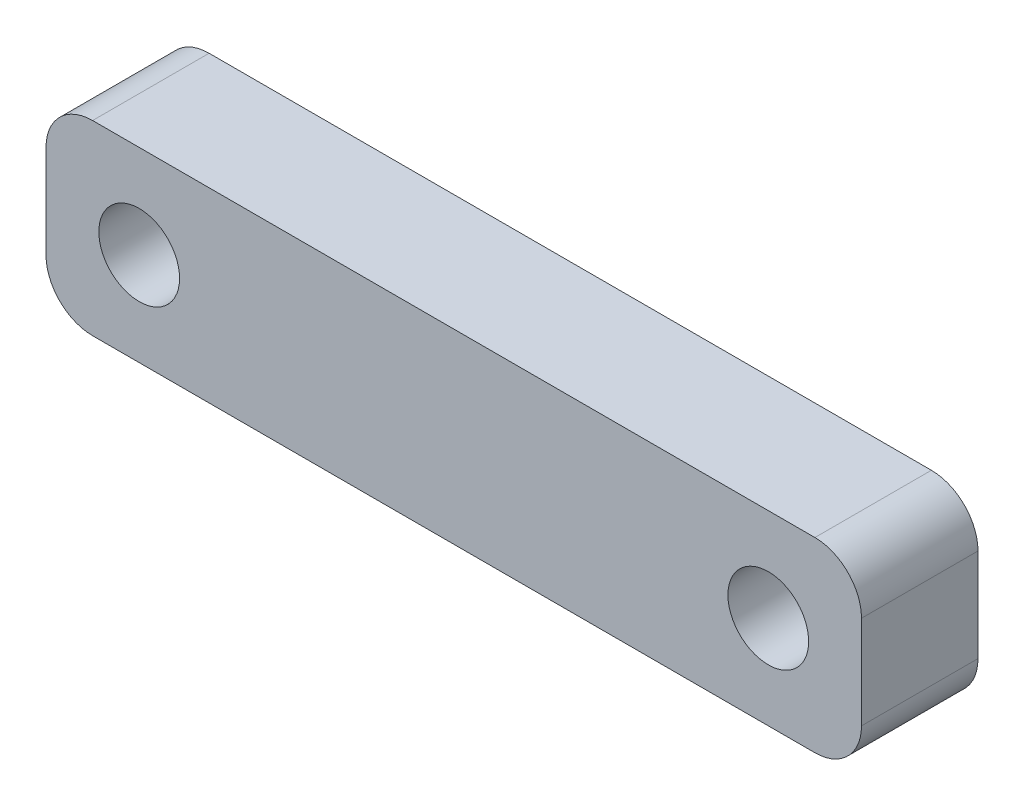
ISO-10303-21;
HEADER;
FILE_DESCRIPTION(('STEP AP214'),'2;1');
FILE_NAME('part.step','',(''),(''),'','','');
FILE_SCHEMA(('AUTOMOTIVE_DESIGN { 1 0 10303 214 1 1 1 1 }'));
ENDSEC;
DATA;
#1=APPLICATION_CONTEXT('core data for automotive mechanical design processes');
#2=APPLICATION_PROTOCOL_DEFINITION('international standard','automotive_design',2000,#1);
#3=PRODUCT_CONTEXT('',#1,'mechanical');
#4=PRODUCT('Part','Part','',(#3));
#5=PRODUCT_RELATED_PRODUCT_CATEGORY('part','',(#4));
#6=PRODUCT_DEFINITION_FORMATION('','',#4);
#7=PRODUCT_DEFINITION_CONTEXT('part definition',#1,'design');
#8=PRODUCT_DEFINITION('design','',#6,#7);
#9=PRODUCT_DEFINITION_SHAPE('','',#8);
#10=(LENGTH_UNIT() NAMED_UNIT(*) SI_UNIT(.MILLI.,.METRE.));
#11=(NAMED_UNIT(*) PLANE_ANGLE_UNIT() SI_UNIT($,.RADIAN.));
#12=(NAMED_UNIT(*) SI_UNIT($,.STERADIAN.) SOLID_ANGLE_UNIT());
#13=UNCERTAINTY_MEASURE_WITH_UNIT(LENGTH_MEASURE(1.E-05),#10,'distance_accuracy_value','');
#14=(GEOMETRIC_REPRESENTATION_CONTEXT(3) GLOBAL_UNCERTAINTY_ASSIGNED_CONTEXT((#13)) GLOBAL_UNIT_ASSIGNED_CONTEXT((#10,
#11,#12)) REPRESENTATION_CONTEXT('',''));
#15=CARTESIAN_POINT('',(0.,0.,0.));
#16=DIRECTION('',(0.,0.,1.));
#17=DIRECTION('',(1.,0.,0.));
#18=AXIS2_PLACEMENT_3D('',#15,#16,#17);
#19=CARTESIAN_POINT('',(0.,0.,6.35));
#20=DIRECTION('',(0.,0.,-1.));
#21=DIRECTION('',(-1.,0.,0.));
#22=AXIS2_PLACEMENT_3D('',#19,#20,#21);
#23=PLANE('',#22);
#24=CARTESIAN_POINT('',(-173.14751190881,-22.7362765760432,6.35));
#25=DIRECTION('',(0.,0.,1.));
#26=DIRECTION('',(1.,0.,0.));
#27=AXIS2_PLACEMENT_3D('',#24,#25,#26);
#28=CIRCLE('',#27,2.20000000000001);
#29=CARTESIAN_POINT('',(-170.94751190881,-22.7362765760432,6.35));
#30=VERTEX_POINT('',#29);
#31=EDGE_CURVE('E168',#30,#30,#28,.T.);
#32=ORIENTED_EDGE('',*,*,#31,.F.);
#33=EDGE_LOOP('',(#32));
#34=FACE_BOUND('',#33,.T.);
#35=DIRECTION('',(0.,1.,0.));
#36=VECTOR('',#35,1.);
#37=CARTESIAN_POINT('',(-133.77751190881,-27.8162765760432,6.35));
#38=LINE('',#37,#36);
#39=CARTESIAN_POINT('',(-133.77751190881,-25.2762765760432,6.35));
#40=VERTEX_POINT('',#39);
#41=CARTESIAN_POINT('',(-133.77751190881,-20.1962765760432,6.35));
#42=VERTEX_POINT('',#41);
#43=EDGE_CURVE('E172',#40,#42,#38,.T.);
#44=ORIENTED_EDGE('',*,*,#43,.T.);
#45=CARTESIAN_POINT('',(-136.31751190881,-20.1962765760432,6.35));
#46=DIRECTION('',(0.,0.,-1.));
#47=DIRECTION('',(-1.,0.,0.));
#48=AXIS2_PLACEMENT_3D('',#45,#46,#47);
#49=CIRCLE('',#48,2.54);
#50=CARTESIAN_POINT('',(-136.31751190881,-17.6562765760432,6.35));
#51=VERTEX_POINT('',#50);
#52=EDGE_CURVE('E149',#42,#51,#49,.F.);
#53=ORIENTED_EDGE('',*,*,#52,.T.);
#54=DIRECTION('',(-1.,0.,0.));
#55=VECTOR('',#54,1.);
#56=CARTESIAN_POINT('',(-178.22751190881,-17.6562765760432,6.35));
#57=LINE('',#56,#55);
#58=CARTESIAN_POINT('',(-175.68751190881,-17.6562765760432,6.35));
#59=VERTEX_POINT('',#58);
#60=EDGE_CURVE('E120',#51,#59,#57,.T.);
#61=ORIENTED_EDGE('',*,*,#60,.T.);
#62=CARTESIAN_POINT('',(-175.68751190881,-20.1962765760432,6.35));
#63=DIRECTION('',(0.,0.,-1.));
#64=DIRECTION('',(-1.,0.,0.));
#65=AXIS2_PLACEMENT_3D('',#62,#63,#64);
#66=CIRCLE('',#65,2.54);
#67=CARTESIAN_POINT('',(-178.22751190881,-20.1962765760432,6.35));
#68=VERTEX_POINT('',#67);
#69=EDGE_CURVE('E145',#59,#68,#66,.F.);
#70=ORIENTED_EDGE('',*,*,#69,.T.);
#71=DIRECTION('',(0.,-1.,0.));
#72=VECTOR('',#71,1.);
#73=CARTESIAN_POINT('',(-178.22751190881,-27.8162765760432,6.35));
#74=LINE('',#73,#72);
#75=CARTESIAN_POINT('',(-178.22751190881,-25.2762765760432,6.35));
#76=VERTEX_POINT('',#75);
#77=EDGE_CURVE('E128',#68,#76,#74,.T.);
#78=ORIENTED_EDGE('',*,*,#77,.T.);
#79=CARTESIAN_POINT('',(-175.68751190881,-25.2762765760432,6.35));
#80=DIRECTION('',(0.,0.,-1.));
#81=DIRECTION('',(-1.,0.,0.));
#82=AXIS2_PLACEMENT_3D('',#79,#80,#81);
#83=CIRCLE('',#82,2.54);
#84=CARTESIAN_POINT('',(-175.68751190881,-27.8162765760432,6.35));
#85=VERTEX_POINT('',#84);
#86=EDGE_CURVE('E55',#76,#85,#83,.F.);
#87=ORIENTED_EDGE('',*,*,#86,.T.);
#88=DIRECTION('',(1.,0.,0.));
#89=VECTOR('',#88,1.);
#90=CARTESIAN_POINT('',(-178.22751190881,-27.8162765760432,6.35));
#91=LINE('',#90,#89);
#92=CARTESIAN_POINT('',(-136.31751190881,-27.8162765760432,6.35));
#93=VERTEX_POINT('',#92);
#94=EDGE_CURVE('E131',#85,#93,#91,.T.);
#95=ORIENTED_EDGE('',*,*,#94,.T.);
#96=CARTESIAN_POINT('',(-136.31751190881,-25.2762765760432,6.35));
#97=DIRECTION('',(0.,0.,-1.));
#98=DIRECTION('',(-1.,0.,0.));
#99=AXIS2_PLACEMENT_3D('',#96,#97,#98);
#100=CIRCLE('',#99,2.54);
#101=EDGE_CURVE('E147',#93,#40,#100,.F.);
#102=ORIENTED_EDGE('',*,*,#101,.T.);
#103=EDGE_LOOP('',(#44,#53,#61,#70,#78,#87,#95,#102));
#104=FACE_BOUND('',#103,.T.);
#105=CARTESIAN_POINT('',(-138.85751190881,-22.7362765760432,6.35));
#106=DIRECTION('',(0.,0.,1.));
#107=DIRECTION('',(-1.,0.,0.));
#108=AXIS2_PLACEMENT_3D('',#105,#106,#107);
#109=CIRCLE('',#108,2.20000000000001);
#110=CARTESIAN_POINT('',(-141.05751190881,-22.7362765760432,6.35));
#111=VERTEX_POINT('',#110);
#112=EDGE_CURVE('E178',#111,#111,#109,.T.);
#113=ORIENTED_EDGE('',*,*,#112,.F.);
#114=EDGE_LOOP('',(#113));
#115=FACE_BOUND('',#114,.T.);
#116=ADVANCED_FACE('F33',(#34,#104,#115),#23,.F.);
#117=CARTESIAN_POINT('',(0.,0.,0.));
#118=DIRECTION('',(0.,0.,-1.));
#119=DIRECTION('',(-1.,0.,0.));
#120=AXIS2_PLACEMENT_3D('',#117,#118,#119);
#121=PLANE('',#120);
#122=CARTESIAN_POINT('',(-173.14751190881,-22.7362765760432,0.));
#123=DIRECTION('',(0.,0.,1.));
#124=DIRECTION('',(1.,0.,0.));
#125=AXIS2_PLACEMENT_3D('',#122,#123,#124);
#126=CIRCLE('',#125,2.20000000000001);
#127=CARTESIAN_POINT('',(-170.94751190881,-22.7362765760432,0.));
#128=VERTEX_POINT('',#127);
#129=EDGE_CURVE('E175',#128,#128,#126,.T.);
#130=ORIENTED_EDGE('',*,*,#129,.T.);
#131=EDGE_LOOP('',(#130));
#132=FACE_BOUND('',#131,.T.);
#133=DIRECTION('',(-1.,0.,0.));
#134=VECTOR('',#133,1.);
#135=CARTESIAN_POINT('',(-178.22751190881,-17.6562765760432,0.));
#136=LINE('',#135,#134);
#137=CARTESIAN_POINT('',(-136.31751190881,-17.6562765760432,0.));
#138=VERTEX_POINT('',#137);
#139=CARTESIAN_POINT('',(-175.68751190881,-17.6562765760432,0.));
#140=VERTEX_POINT('',#139);
#141=EDGE_CURVE('E117',#138,#140,#136,.T.);
#142=ORIENTED_EDGE('',*,*,#141,.F.);
#143=CARTESIAN_POINT('',(-136.31751190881,-20.1962765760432,0.));
#144=DIRECTION('',(0.,0.,-1.));
#145=DIRECTION('',(-1.,0.,0.));
#146=AXIS2_PLACEMENT_3D('',#143,#144,#145);
#147=CIRCLE('',#146,2.54);
#148=CARTESIAN_POINT('',(-133.77751190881,-20.1962765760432,0.));
#149=VERTEX_POINT('',#148);
#150=EDGE_CURVE('E100',#138,#149,#147,.T.);
#151=ORIENTED_EDGE('',*,*,#150,.T.);
#152=DIRECTION('',(0.,1.,0.));
#153=VECTOR('',#152,1.);
#154=CARTESIAN_POINT('',(-133.77751190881,-27.8162765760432,0.));
#155=LINE('',#154,#153);
#156=CARTESIAN_POINT('',(-133.77751190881,-25.2762765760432,0.));
#157=VERTEX_POINT('',#156);
#158=EDGE_CURVE('E129',#157,#149,#155,.T.);
#159=ORIENTED_EDGE('',*,*,#158,.F.);
#160=CARTESIAN_POINT('',(-136.31751190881,-25.2762765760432,0.));
#161=DIRECTION('',(0.,0.,-1.));
#162=DIRECTION('',(-1.,0.,0.));
#163=AXIS2_PLACEMENT_3D('',#160,#161,#162);
#164=CIRCLE('',#163,2.54);
#165=CARTESIAN_POINT('',(-136.31751190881,-27.8162765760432,0.));
#166=VERTEX_POINT('',#165);
#167=EDGE_CURVE('E111',#157,#166,#164,.T.);
#168=ORIENTED_EDGE('',*,*,#167,.T.);
#169=DIRECTION('',(1.,0.,0.));
#170=VECTOR('',#169,1.);
#171=CARTESIAN_POINT('',(-178.22751190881,-27.8162765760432,0.));
#172=LINE('',#171,#170);
#173=CARTESIAN_POINT('',(-175.68751190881,-27.8162765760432,0.));
#174=VERTEX_POINT('',#173);
#175=EDGE_CURVE('E133',#174,#166,#172,.T.);
#176=ORIENTED_EDGE('',*,*,#175,.F.);
#177=CARTESIAN_POINT('',(-175.68751190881,-25.2762765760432,0.));
#178=DIRECTION('',(0.,0.,-1.));
#179=DIRECTION('',(-1.,0.,0.));
#180=AXIS2_PLACEMENT_3D('',#177,#178,#179);
#181=CIRCLE('',#180,2.54);
#182=CARTESIAN_POINT('',(-178.22751190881,-25.2762765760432,0.));
#183=VERTEX_POINT('',#182);
#184=EDGE_CURVE('E121',#174,#183,#181,.T.);
#185=ORIENTED_EDGE('',*,*,#184,.T.);
#186=DIRECTION('',(0.,-1.,0.));
#187=VECTOR('',#186,1.);
#188=CARTESIAN_POINT('',(-178.22751190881,-27.8162765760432,0.));
#189=LINE('',#188,#187);
#190=CARTESIAN_POINT('',(-178.22751190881,-20.1962765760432,0.));
#191=VERTEX_POINT('',#190);
#192=EDGE_CURVE('E160',#191,#183,#189,.T.);
#193=ORIENTED_EDGE('',*,*,#192,.F.);
#194=CARTESIAN_POINT('',(-175.68751190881,-20.1962765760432,0.));
#195=DIRECTION('',(0.,0.,-1.));
#196=DIRECTION('',(-1.,0.,0.));
#197=AXIS2_PLACEMENT_3D('',#194,#195,#196);
#198=CIRCLE('',#197,2.54);
#199=EDGE_CURVE('E127',#191,#140,#198,.T.);
#200=ORIENTED_EDGE('',*,*,#199,.T.);
#201=EDGE_LOOP('',(#142,#151,#159,#168,#176,#185,#193,#200));
#202=FACE_BOUND('',#201,.T.);
#203=CARTESIAN_POINT('',(-138.85751190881,-22.7362765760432,0.));
#204=DIRECTION('',(0.,0.,1.));
#205=DIRECTION('',(-1.,0.,0.));
#206=AXIS2_PLACEMENT_3D('',#203,#204,#205);
#207=CIRCLE('',#206,2.20000000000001);
#208=CARTESIAN_POINT('',(-141.05751190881,-22.7362765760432,0.));
#209=VERTEX_POINT('',#208);
#210=EDGE_CURVE('E181',#209,#209,#207,.T.);
#211=ORIENTED_EDGE('',*,*,#210,.T.);
#212=EDGE_LOOP('',(#211));
#213=FACE_BOUND('',#212,.T.);
#214=ADVANCED_FACE('F124',(#132,#202,#213),#121,.T.);
#215=CARTESIAN_POINT('',(-178.22751190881,-27.8162765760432,6.35));
#216=DIRECTION('',(1.,0.,0.));
#217=DIRECTION('',(0.,0.,-1.));
#218=AXIS2_PLACEMENT_3D('',#215,#216,#217);
#219=PLANE('',#218);
#220=ORIENTED_EDGE('',*,*,#77,.F.);
#221=DIRECTION('',(0.,0.,-1.));
#222=VECTOR('',#221,1.);
#223=CARTESIAN_POINT('',(-178.22751190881,-20.1962765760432,6.35));
#224=LINE('',#223,#222);
#225=EDGE_CURVE('E11',#68,#191,#224,.T.);
#226=ORIENTED_EDGE('',*,*,#225,.T.);
#227=ORIENTED_EDGE('',*,*,#192,.T.);
#228=DIRECTION('',(0.,0.,-1.));
#229=VECTOR('',#228,1.);
#230=CARTESIAN_POINT('',(-178.22751190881,-25.2762765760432,6.35));
#231=LINE('',#230,#229);
#232=EDGE_CURVE('E41',#183,#76,#231,.F.);
#233=ORIENTED_EDGE('',*,*,#232,.T.);
#234=EDGE_LOOP('',(#220,#226,#227,#233));
#235=FACE_BOUND('',#234,.T.);
#236=ADVANCED_FACE('F158',(#235),#219,.F.);
#237=CARTESIAN_POINT('',(-178.22751190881,-27.8162765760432,6.35));
#238=DIRECTION('',(0.,1.,0.));
#239=DIRECTION('',(0.,0.,1.));
#240=AXIS2_PLACEMENT_3D('',#237,#238,#239);
#241=PLANE('',#240);
#242=ORIENTED_EDGE('',*,*,#175,.T.);
#243=DIRECTION('',(0.,0.,-1.));
#244=VECTOR('',#243,1.);
#245=CARTESIAN_POINT('',(-136.31751190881,-27.8162765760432,6.35));
#246=LINE('',#245,#244);
#247=EDGE_CURVE('E48',#166,#93,#246,.F.);
#248=ORIENTED_EDGE('',*,*,#247,.T.);
#249=ORIENTED_EDGE('',*,*,#94,.F.);
#250=DIRECTION('',(0.,0.,-1.));
#251=VECTOR('',#250,1.);
#252=CARTESIAN_POINT('',(-175.68751190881,-27.8162765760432,6.35));
#253=LINE('',#252,#251);
#254=EDGE_CURVE('E151',#85,#174,#253,.T.);
#255=ORIENTED_EDGE('',*,*,#254,.T.);
#256=EDGE_LOOP('',(#242,#248,#249,#255));
#257=FACE_BOUND('',#256,.T.);
#258=ADVANCED_FACE('F167',(#257),#241,.F.);
#259=CARTESIAN_POINT('',(-133.77751190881,-27.8162765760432,6.35));
#260=DIRECTION('',(-1.,0.,0.));
#261=DIRECTION('',(0.,0.,1.));
#262=AXIS2_PLACEMENT_3D('',#259,#260,#261);
#263=PLANE('',#262);
#264=ORIENTED_EDGE('',*,*,#158,.T.);
#265=DIRECTION('',(0.,0.,-1.));
#266=VECTOR('',#265,1.);
#267=CARTESIAN_POINT('',(-133.77751190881,-20.1962765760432,6.35));
#268=LINE('',#267,#266);
#269=EDGE_CURVE('E105',#149,#42,#268,.F.);
#270=ORIENTED_EDGE('',*,*,#269,.T.);
#271=ORIENTED_EDGE('',*,*,#43,.F.);
#272=DIRECTION('',(0.,0.,-1.));
#273=VECTOR('',#272,1.);
#274=CARTESIAN_POINT('',(-133.77751190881,-25.2762765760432,6.35));
#275=LINE('',#274,#273);
#276=EDGE_CURVE('E110',#40,#157,#275,.T.);
#277=ORIENTED_EDGE('',*,*,#276,.T.);
#278=EDGE_LOOP('',(#264,#270,#271,#277));
#279=FACE_BOUND('',#278,.T.);
#280=ADVANCED_FACE('F204',(#279),#263,.F.);
#281=CARTESIAN_POINT('',(-178.22751190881,-17.6562765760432,6.35));
#282=DIRECTION('',(0.,-1.,0.));
#283=DIRECTION('',(0.,0.,-1.));
#284=AXIS2_PLACEMENT_3D('',#281,#282,#283);
#285=PLANE('',#284);
#286=ORIENTED_EDGE('',*,*,#60,.F.);
#287=DIRECTION('',(0.,0.,-1.));
#288=VECTOR('',#287,1.);
#289=CARTESIAN_POINT('',(-136.31751190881,-17.6562765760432,6.35));
#290=LINE('',#289,#288);
#291=EDGE_CURVE('E104',#51,#138,#290,.T.);
#292=ORIENTED_EDGE('',*,*,#291,.T.);
#293=ORIENTED_EDGE('',*,*,#141,.T.);
#294=DIRECTION('',(0.,0.,-1.));
#295=VECTOR('',#294,1.);
#296=CARTESIAN_POINT('',(-175.68751190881,-17.6562765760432,6.35));
#297=LINE('',#296,#295);
#298=EDGE_CURVE('E122',#140,#59,#297,.F.);
#299=ORIENTED_EDGE('',*,*,#298,.T.);
#300=EDGE_LOOP('',(#286,#292,#293,#299));
#301=FACE_BOUND('',#300,.T.);
#302=ADVANCED_FACE('F116',(#301),#285,.F.);
#303=CARTESIAN_POINT('',(-173.14751190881,-22.7362765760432,6.35));
#304=DIRECTION('',(0.,0.,-1.));
#305=DIRECTION('',(-1.,0.,0.));
#306=AXIS2_PLACEMENT_3D('',#303,#304,#305);
#307=CYLINDRICAL_SURFACE('',#306,2.20000000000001);
#308=ORIENTED_EDGE('',*,*,#31,.T.);
#309=EDGE_LOOP('',(#308));
#310=FACE_BOUND('',#309,.T.);
#311=ORIENTED_EDGE('',*,*,#129,.F.);
#312=EDGE_LOOP('',(#311));
#313=FACE_BOUND('',#312,.T.);
#314=ADVANCED_FACE('F199',(#310,#313),#307,.F.);
#315=CARTESIAN_POINT('',(-138.85751190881,-22.7362765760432,6.35));
#316=DIRECTION('',(0.,0.,-1.));
#317=DIRECTION('',(-1.,0.,0.));
#318=AXIS2_PLACEMENT_3D('',#315,#316,#317);
#319=CYLINDRICAL_SURFACE('',#318,2.20000000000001);
#320=ORIENTED_EDGE('',*,*,#112,.T.);
#321=EDGE_LOOP('',(#320));
#322=FACE_BOUND('',#321,.T.);
#323=ORIENTED_EDGE('',*,*,#210,.F.);
#324=EDGE_LOOP('',(#323));
#325=FACE_BOUND('',#324,.T.);
#326=ADVANCED_FACE('F187',(#322,#325),#319,.F.);
#327=CARTESIAN_POINT('',(-136.31751190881,-20.1962765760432,6.35));
#328=DIRECTION('',(0.,0.,-1.));
#329=DIRECTION('',(-1.,0.,0.));
#330=AXIS2_PLACEMENT_3D('',#327,#328,#329);
#331=CYLINDRICAL_SURFACE('',#330,2.54);
#332=ORIENTED_EDGE('',*,*,#52,.F.);
#333=ORIENTED_EDGE('',*,*,#269,.F.);
#334=ORIENTED_EDGE('',*,*,#150,.F.);
#335=ORIENTED_EDGE('',*,*,#291,.F.);
#336=EDGE_LOOP('',(#332,#333,#334,#335));
#337=FACE_BOUND('',#336,.T.);
#338=ADVANCED_FACE('F103',(#337),#331,.T.);
#339=CARTESIAN_POINT('',(-136.31751190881,-25.2762765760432,6.35));
#340=DIRECTION('',(0.,0.,-1.));
#341=DIRECTION('',(-1.,0.,0.));
#342=AXIS2_PLACEMENT_3D('',#339,#340,#341);
#343=CYLINDRICAL_SURFACE('',#342,2.54);
#344=ORIENTED_EDGE('',*,*,#101,.F.);
#345=ORIENTED_EDGE('',*,*,#247,.F.);
#346=ORIENTED_EDGE('',*,*,#167,.F.);
#347=ORIENTED_EDGE('',*,*,#276,.F.);
#348=EDGE_LOOP('',(#344,#345,#346,#347));
#349=FACE_BOUND('',#348,.T.);
#350=ADVANCED_FACE('F214',(#349),#343,.T.);
#351=CARTESIAN_POINT('',(-175.68751190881,-20.1962765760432,6.35));
#352=DIRECTION('',(0.,0.,-1.));
#353=DIRECTION('',(-1.,0.,0.));
#354=AXIS2_PLACEMENT_3D('',#351,#352,#353);
#355=CYLINDRICAL_SURFACE('',#354,2.54);
#356=ORIENTED_EDGE('',*,*,#69,.F.);
#357=ORIENTED_EDGE('',*,*,#298,.F.);
#358=ORIENTED_EDGE('',*,*,#199,.F.);
#359=ORIENTED_EDGE('',*,*,#225,.F.);
#360=EDGE_LOOP('',(#356,#357,#358,#359));
#361=FACE_BOUND('',#360,.T.);
#362=ADVANCED_FACE('F216',(#361),#355,.T.);
#363=CARTESIAN_POINT('',(-175.68751190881,-25.2762765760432,6.35));
#364=DIRECTION('',(0.,0.,-1.));
#365=DIRECTION('',(-1.,0.,0.));
#366=AXIS2_PLACEMENT_3D('',#363,#364,#365);
#367=CYLINDRICAL_SURFACE('',#366,2.54);
#368=ORIENTED_EDGE('',*,*,#86,.F.);
#369=ORIENTED_EDGE('',*,*,#232,.F.);
#370=ORIENTED_EDGE('',*,*,#184,.F.);
#371=ORIENTED_EDGE('',*,*,#254,.F.);
#372=EDGE_LOOP('',(#368,#369,#370,#371));
#373=FACE_BOUND('',#372,.T.);
#374=ADVANCED_FACE('F35',(#373),#367,.T.);
#375=CLOSED_SHELL('',(#116,#214,#236,#258,#280,#302,#314,#326,#338,#350,#362,#374));
#376=MANIFOLD_SOLID_BREP('B2',#375);
#377=ADVANCED_BREP_SHAPE_REPRESENTATION('',(#18,#376),#14);
#378=SHAPE_DEFINITION_REPRESENTATION(#9,#377);
ENDSEC;
END-ISO-10303-21;
